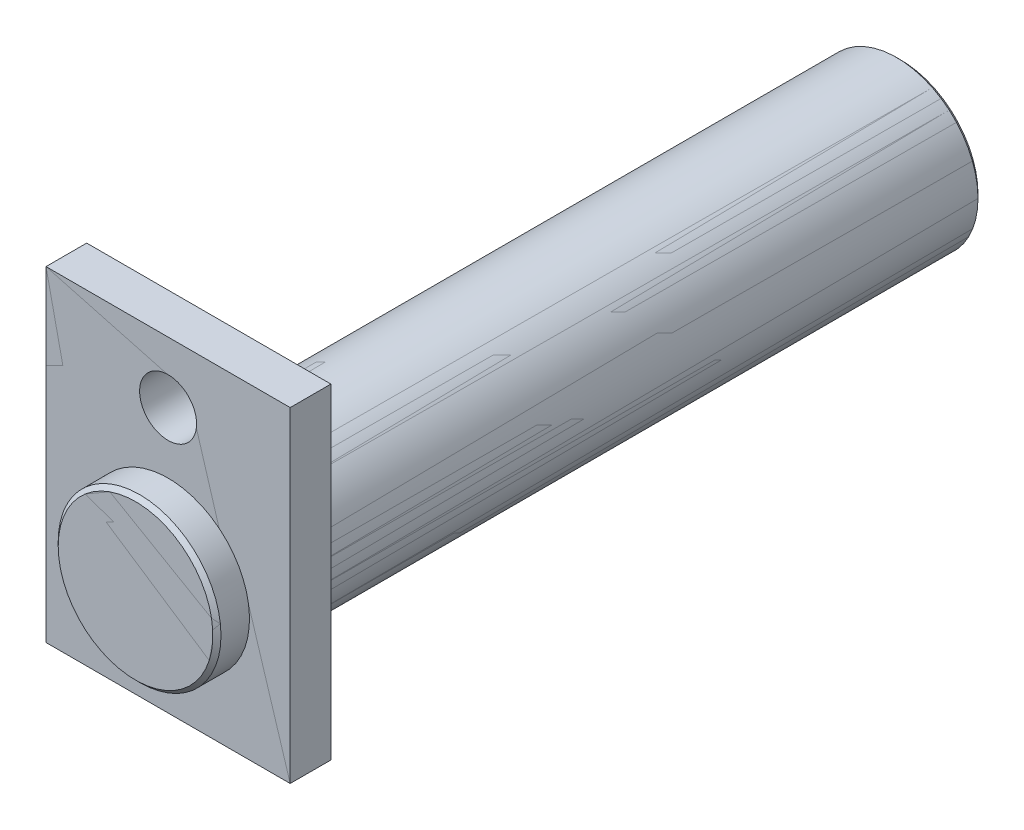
ISO-10303-21;
HEADER;
FILE_DESCRIPTION(('STEP AP214'),'2;1');
FILE_NAME('part.step','',(''),(''),'','','');
FILE_SCHEMA(('AUTOMOTIVE_DESIGN { 1 0 10303 214 1 1 1 1 }'));
ENDSEC;
DATA;
#1=APPLICATION_CONTEXT('core data for automotive mechanical design processes');
#2=APPLICATION_PROTOCOL_DEFINITION('international standard','automotive_design',2000,#1);
#3=PRODUCT_CONTEXT('',#1,'mechanical');
#4=PRODUCT('Part','Part','',(#3));
#5=PRODUCT_RELATED_PRODUCT_CATEGORY('part','',(#4));
#6=PRODUCT_DEFINITION_FORMATION('','',#4);
#7=PRODUCT_DEFINITION_CONTEXT('part definition',#1,'design');
#8=PRODUCT_DEFINITION('design','',#6,#7);
#9=PRODUCT_DEFINITION_SHAPE('','',#8);
#10=(LENGTH_UNIT() NAMED_UNIT(*) SI_UNIT(.MILLI.,.METRE.));
#11=(NAMED_UNIT(*) PLANE_ANGLE_UNIT() SI_UNIT($,.RADIAN.));
#12=(NAMED_UNIT(*) SI_UNIT($,.STERADIAN.) SOLID_ANGLE_UNIT());
#13=UNCERTAINTY_MEASURE_WITH_UNIT(LENGTH_MEASURE(1.E-05),#10,'distance_accuracy_value','');
#14=(GEOMETRIC_REPRESENTATION_CONTEXT(3) GLOBAL_UNCERTAINTY_ASSIGNED_CONTEXT((#13)) GLOBAL_UNIT_ASSIGNED_CONTEXT((#10,
#11,#12)) REPRESENTATION_CONTEXT('',''));
#15=CARTESIAN_POINT('',(0.,0.,0.));
#16=DIRECTION('',(0.,0.,1.));
#17=DIRECTION('',(1.,0.,0.));
#18=AXIS2_PLACEMENT_3D('',#15,#16,#17);
#19=CARTESIAN_POINT('',(9.5,-9.5,-85.));
#20=DIRECTION('',(0.,0.,-1.));
#21=DIRECTION('',(-1.,0.,0.));
#22=AXIS2_PLACEMENT_3D('',#19,#20,#21);
#23=PLANE('',#22);
#24=CARTESIAN_POINT('',(0.,0.,-85.));
#25=DIRECTION('',(0.,0.,1.));
#26=DIRECTION('',(1.,0.,0.));
#27=AXIS2_PLACEMENT_3D('',#24,#25,#26);
#28=CIRCLE('',#27,9.5);
#29=CARTESIAN_POINT('',(9.5,0.,-85.));
#30=VERTEX_POINT('',#29);
#31=EDGE_CURVE('P0_E352',#30,#30,#28,.F.);
#32=ORIENTED_EDGE('',*,*,#31,.T.);
#33=EDGE_LOOP('',(#32));
#34=FACE_BOUND('',#33,.T.);
#35=ADVANCED_FACE('P0_F348',(#34),#23,.T.);
#36=CARTESIAN_POINT('',(0.,0.,-85.));
#37=DIRECTION('',(0.,0.,1.));
#38=DIRECTION('',(1.,0.,0.));
#39=AXIS2_PLACEMENT_3D('',#36,#37,#38);
#40=CONICAL_SURFACE('',#39,9.5,0.785398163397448);
#41=ORIENTED_EDGE('',*,*,#31,.F.);
#42=EDGE_LOOP('',(#41));
#43=FACE_BOUND('',#42,.T.);
#44=CARTESIAN_POINT('',(0.,0.,-84.5));
#45=DIRECTION('',(0.,0.,1.));
#46=DIRECTION('',(1.,0.,0.));
#47=AXIS2_PLACEMENT_3D('',#44,#45,#46);
#48=CIRCLE('',#47,10.);
#49=CARTESIAN_POINT('',(10.,0.,-84.5));
#50=VERTEX_POINT('',#49);
#51=EDGE_CURVE('P0_E440',#50,#50,#48,.F.);
#52=ORIENTED_EDGE('',*,*,#51,.T.);
#53=EDGE_LOOP('',(#52));
#54=FACE_BOUND('',#53,.T.);
#55=ADVANCED_FACE('P0_F454',(#43,#54),#40,.T.);
#56=CARTESIAN_POINT('',(-9.5,-9.5,9.));
#57=DIRECTION('',(0.,0.,1.));
#58=DIRECTION('',(1.,0.,0.));
#59=AXIS2_PLACEMENT_3D('',#56,#57,#58);
#60=PLANE('',#59);
#61=CARTESIAN_POINT('',(0.,0.,9.));
#62=DIRECTION('',(0.,0.,-1.));
#63=DIRECTION('',(-1.,0.,0.));
#64=AXIS2_PLACEMENT_3D('',#61,#62,#63);
#65=CIRCLE('',#64,9.5);
#66=CARTESIAN_POINT('',(-9.5,0.,9.));
#67=VERTEX_POINT('',#66);
#68=EDGE_CURVE('P0_E438',#67,#67,#65,.F.);
#69=ORIENTED_EDGE('',*,*,#68,.T.);
#70=EDGE_LOOP('',(#69));
#71=FACE_BOUND('',#70,.T.);
#72=ADVANCED_FACE('P0_F456',(#71),#60,.T.);
#73=CARTESIAN_POINT('',(0.,0.,-84.5));
#74=DIRECTION('',(0.,0.,1.));
#75=DIRECTION('',(0.,-1.,0.));
#76=AXIS2_PLACEMENT_3D('',#73,#74,#75);
#77=CYLINDRICAL_SURFACE('',#76,10.);
#78=ORIENTED_EDGE('',*,*,#51,.F.);
#79=EDGE_LOOP('',(#78));
#80=FACE_BOUND('',#79,.T.);
#81=CARTESIAN_POINT('',(0.,0.,0.));
#82=DIRECTION('',(0.,0.,1.));
#83=DIRECTION('',(0.,-1.,0.));
#84=AXIS2_PLACEMENT_3D('',#81,#82,#83);
#85=CIRCLE('',#84,10.);
#86=CARTESIAN_POINT('',(0.,-10.0000000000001,0.));
#87=VERTEX_POINT('',#86);
#88=EDGE_CURVE('P0_E400',#87,#87,#85,.T.);
#89=ORIENTED_EDGE('',*,*,#88,.F.);
#90=EDGE_LOOP('',(#89));
#91=FACE_BOUND('',#90,.T.);
#92=ADVANCED_FACE('P0_F462',(#80,#91),#77,.T.);
#93=CARTESIAN_POINT('',(0.,0.,8.5));
#94=DIRECTION('',(0.,0.,-1.));
#95=DIRECTION('',(-1.,0.,0.));
#96=AXIS2_PLACEMENT_3D('',#93,#94,#95);
#97=CONICAL_SURFACE('',#96,10.,0.785398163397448);
#98=CARTESIAN_POINT('',(0.,0.,8.5));
#99=DIRECTION('',(0.,0.,1.));
#100=DIRECTION('',(1.,0.,0.));
#101=AXIS2_PLACEMENT_3D('',#98,#99,#100);
#102=CIRCLE('',#101,10.);
#103=CARTESIAN_POINT('',(10.,0.,8.5));
#104=VERTEX_POINT('',#103);
#105=EDGE_CURVE('P0_E418',#104,#104,#102,.T.);
#106=ORIENTED_EDGE('',*,*,#105,.T.);
#107=EDGE_LOOP('',(#106));
#108=FACE_BOUND('',#107,.T.);
#109=ORIENTED_EDGE('',*,*,#68,.F.);
#110=EDGE_LOOP('',(#109));
#111=FACE_BOUND('',#110,.T.);
#112=ADVANCED_FACE('P0_F496',(#108,#111),#97,.T.);
#113=CARTESIAN_POINT('',(15.,-15.,0.));
#114=DIRECTION('',(0.,0.,-1.));
#115=DIRECTION('',(-1.,0.,0.));
#116=AXIS2_PLACEMENT_3D('',#113,#114,#115);
#117=PLANE('',#116);
#118=CARTESIAN_POINT('',(0.,17.5,0.));
#119=DIRECTION('',(0.,0.,1.));
#120=DIRECTION('',(1.,0.,0.));
#121=AXIS2_PLACEMENT_3D('',#118,#119,#120);
#122=CIRCLE('',#121,3.5);
#123=CARTESIAN_POINT('',(3.5,17.5,0.));
#124=VERTEX_POINT('',#123);
#125=EDGE_CURVE('P0_E424',#124,#124,#122,.F.);
#126=ORIENTED_EDGE('',*,*,#125,.F.);
#127=EDGE_LOOP('',(#126));
#128=FACE_BOUND('',#127,.T.);
#129=ORIENTED_EDGE('',*,*,#88,.T.);
#130=EDGE_LOOP('',(#129));
#131=FACE_BOUND('',#130,.T.);
#132=DIRECTION('',(-1.,0.,0.));
#133=VECTOR('',#132,1.);
#134=CARTESIAN_POINT('',(0.,25.,-1.00613961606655E-13));
#135=LINE('',#134,#133);
#136=CARTESIAN_POINT('',(15.,25.,0.));
#137=VERTEX_POINT('',#136);
#138=CARTESIAN_POINT('',(-15.,25.,0.));
#139=VERTEX_POINT('',#138);
#140=EDGE_CURVE('P0_E403',#137,#139,#135,.T.);
#141=ORIENTED_EDGE('',*,*,#140,.F.);
#142=DIRECTION('',(0.,1.,0.));
#143=VECTOR('',#142,1.);
#144=CARTESIAN_POINT('',(15.,5.,0.));
#145=LINE('',#144,#143);
#146=CARTESIAN_POINT('',(15.,-15.,0.));
#147=VERTEX_POINT('',#146);
#148=EDGE_CURVE('P0_E388',#147,#137,#145,.T.);
#149=ORIENTED_EDGE('',*,*,#148,.F.);
#150=DIRECTION('',(1.,0.,0.));
#151=VECTOR('',#150,1.);
#152=CARTESIAN_POINT('',(0.,-15.,-1.00613961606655E-13));
#153=LINE('',#152,#151);
#154=CARTESIAN_POINT('',(-15.,-15.,0.));
#155=VERTEX_POINT('',#154);
#156=EDGE_CURVE('P0_E419',#155,#147,#153,.T.);
#157=ORIENTED_EDGE('',*,*,#156,.F.);
#158=DIRECTION('',(0.,-1.,0.));
#159=VECTOR('',#158,1.);
#160=CARTESIAN_POINT('',(-15.,5.,0.));
#161=LINE('',#160,#159);
#162=EDGE_CURVE('P0_E405',#139,#155,#161,.T.);
#163=ORIENTED_EDGE('',*,*,#162,.F.);
#164=EDGE_LOOP('',(#141,#149,#157,#163));
#165=FACE_BOUND('',#164,.T.);
#166=ADVANCED_FACE('P0_F404',(#128,#131,#165),#117,.T.);
#167=CARTESIAN_POINT('',(15.,-15.,5.));
#168=DIRECTION('',(1.,0.,0.));
#169=DIRECTION('',(0.,0.,-1.));
#170=AXIS2_PLACEMENT_3D('',#167,#168,#169);
#171=PLANE('',#170);
#172=ORIENTED_EDGE('',*,*,#148,.T.);
#173=DIRECTION('',(0.,0.,-1.));
#174=VECTOR('',#173,1.);
#175=CARTESIAN_POINT('',(15.,25.,-10.));
#176=LINE('',#175,#174);
#177=CARTESIAN_POINT('',(15.,25.,5.));
#178=VERTEX_POINT('',#177);
#179=EDGE_CURVE('P0_E396',#178,#137,#176,.T.);
#180=ORIENTED_EDGE('',*,*,#179,.F.);
#181=DIRECTION('',(0.,1.,0.));
#182=VECTOR('',#181,1.);
#183=CARTESIAN_POINT('',(15.,5.,5.));
#184=LINE('',#183,#182);
#185=CARTESIAN_POINT('',(15.,-15.,5.));
#186=VERTEX_POINT('',#185);
#187=EDGE_CURVE('P0_E381',#186,#178,#184,.T.);
#188=ORIENTED_EDGE('',*,*,#187,.F.);
#189=DIRECTION('',(0.,0.,1.));
#190=VECTOR('',#189,1.);
#191=CARTESIAN_POINT('',(15.,-15.,-10.));
#192=LINE('',#191,#190);
#193=EDGE_CURVE('P0_E398',#147,#186,#192,.T.);
#194=ORIENTED_EDGE('',*,*,#193,.F.);
#195=EDGE_LOOP('',(#172,#180,#188,#194));
#196=FACE_BOUND('',#195,.T.);
#197=ADVANCED_FACE('P0_F394',(#196),#171,.T.);
#198=CARTESIAN_POINT('',(15.,25.,5.));
#199=DIRECTION('',(0.,1.,0.));
#200=DIRECTION('',(0.,0.,-1.));
#201=AXIS2_PLACEMENT_3D('',#198,#199,#200);
#202=PLANE('',#201);
#203=ORIENTED_EDGE('',*,*,#140,.T.);
#204=DIRECTION('',(0.,0.,-1.));
#205=VECTOR('',#204,1.);
#206=CARTESIAN_POINT('',(-15.,25.,-15.));
#207=LINE('',#206,#205);
#208=CARTESIAN_POINT('',(-15.,25.,5.));
#209=VERTEX_POINT('',#208);
#210=EDGE_CURVE('P0_E408',#209,#139,#207,.T.);
#211=ORIENTED_EDGE('',*,*,#210,.F.);
#212=DIRECTION('',(-1.,0.,0.));
#213=VECTOR('',#212,1.);
#214=CARTESIAN_POINT('',(5.,25.,5.));
#215=LINE('',#214,#213);
#216=EDGE_CURVE('P0_E412',#178,#209,#215,.T.);
#217=ORIENTED_EDGE('',*,*,#216,.F.);
#218=ORIENTED_EDGE('',*,*,#179,.T.);
#219=EDGE_LOOP('',(#203,#211,#217,#218));
#220=FACE_BOUND('',#219,.T.);
#221=ADVANCED_FACE('P0_F410',(#220),#202,.T.);
#222=CARTESIAN_POINT('',(-15.,25.,5.));
#223=DIRECTION('',(-1.,0.,0.));
#224=DIRECTION('',(0.,0.,-1.));
#225=AXIS2_PLACEMENT_3D('',#222,#223,#224);
#226=PLANE('',#225);
#227=ORIENTED_EDGE('',*,*,#162,.T.);
#228=DIRECTION('',(0.,0.,-1.));
#229=VECTOR('',#228,1.);
#230=CARTESIAN_POINT('',(-15.,-15.,-10.));
#231=LINE('',#230,#229);
#232=CARTESIAN_POINT('',(-15.,-15.,5.));
#233=VERTEX_POINT('',#232);
#234=EDGE_CURVE('P0_E367',#233,#155,#231,.T.);
#235=ORIENTED_EDGE('',*,*,#234,.F.);
#236=DIRECTION('',(0.,-1.,0.));
#237=VECTOR('',#236,1.);
#238=CARTESIAN_POINT('',(-15.,5.,5.));
#239=LINE('',#238,#237);
#240=EDGE_CURVE('P0_E428',#209,#233,#239,.T.);
#241=ORIENTED_EDGE('',*,*,#240,.F.);
#242=ORIENTED_EDGE('',*,*,#210,.T.);
#243=EDGE_LOOP('',(#227,#235,#241,#242));
#244=FACE_BOUND('',#243,.T.);
#245=ADVANCED_FACE('P0_F479',(#244),#226,.T.);
#246=CARTESIAN_POINT('',(-15.,-15.,5.));
#247=DIRECTION('',(0.,-1.,0.));
#248=DIRECTION('',(0.,0.,-1.));
#249=AXIS2_PLACEMENT_3D('',#246,#247,#248);
#250=PLANE('',#249);
#251=ORIENTED_EDGE('',*,*,#156,.T.);
#252=ORIENTED_EDGE('',*,*,#193,.T.);
#253=DIRECTION('',(1.,0.,0.));
#254=VECTOR('',#253,1.);
#255=CARTESIAN_POINT('',(5.,-15.,5.));
#256=LINE('',#255,#254);
#257=EDGE_CURVE('P0_E425',#233,#186,#256,.T.);
#258=ORIENTED_EDGE('',*,*,#257,.F.);
#259=ORIENTED_EDGE('',*,*,#234,.T.);
#260=EDGE_LOOP('',(#251,#252,#258,#259));
#261=FACE_BOUND('',#260,.T.);
#262=ADVANCED_FACE('P0_F481',(#261),#250,.T.);
#263=CARTESIAN_POINT('',(0.,0.,5.));
#264=DIRECTION('',(0.,0.,1.));
#265=DIRECTION('',(0.,-1.,0.));
#266=AXIS2_PLACEMENT_3D('',#263,#264,#265);
#267=CYLINDRICAL_SURFACE('',#266,10.);
#268=CARTESIAN_POINT('',(0.,0.,5.));
#269=DIRECTION('',(0.,0.,1.));
#270=DIRECTION('',(0.,-1.,0.));
#271=AXIS2_PLACEMENT_3D('',#268,#269,#270);
#272=CIRCLE('',#271,10.);
#273=CARTESIAN_POINT('',(0.,-10.,5.));
#274=VERTEX_POINT('',#273);
#275=EDGE_CURVE('P0_E358',#274,#274,#272,.F.);
#276=ORIENTED_EDGE('',*,*,#275,.F.);
#277=EDGE_LOOP('',(#276));
#278=FACE_BOUND('',#277,.T.);
#279=ORIENTED_EDGE('',*,*,#105,.F.);
#280=EDGE_LOOP('',(#279));
#281=FACE_BOUND('',#280,.T.);
#282=ADVANCED_FACE('P0_F472',(#278,#281),#267,.T.);
#283=CARTESIAN_POINT('',(0.,17.5,0.));
#284=DIRECTION('',(0.,0.,1.));
#285=DIRECTION('',(1.,0.,0.));
#286=AXIS2_PLACEMENT_3D('',#283,#284,#285);
#287=CYLINDRICAL_SURFACE('',#286,3.5);
#288=ORIENTED_EDGE('',*,*,#125,.T.);
#289=EDGE_LOOP('',(#288));
#290=FACE_BOUND('',#289,.T.);
#291=CARTESIAN_POINT('',(0.,17.5,5.));
#292=DIRECTION('',(0.,0.,1.));
#293=DIRECTION('',(1.,0.,0.));
#294=AXIS2_PLACEMENT_3D('',#291,#292,#293);
#295=CIRCLE('',#294,3.5);
#296=CARTESIAN_POINT('',(3.5,17.5,5.));
#297=VERTEX_POINT('',#296);
#298=EDGE_CURVE('P0_E11',#297,#297,#295,.F.);
#299=ORIENTED_EDGE('',*,*,#298,.F.);
#300=EDGE_LOOP('',(#299));
#301=FACE_BOUND('',#300,.T.);
#302=ADVANCED_FACE('P0_F467',(#290,#301),#287,.F.);
#303=CARTESIAN_POINT('',(-15.,-15.,5.));
#304=DIRECTION('',(0.,0.,1.));
#305=DIRECTION('',(1.,0.,0.));
#306=AXIS2_PLACEMENT_3D('',#303,#304,#305);
#307=PLANE('',#306);
#308=ORIENTED_EDGE('',*,*,#298,.T.);
#309=EDGE_LOOP('',(#308));
#310=FACE_BOUND('',#309,.T.);
#311=ORIENTED_EDGE('',*,*,#275,.T.);
#312=EDGE_LOOP('',(#311));
#313=FACE_BOUND('',#312,.T.);
#314=ORIENTED_EDGE('',*,*,#240,.T.);
#315=ORIENTED_EDGE('',*,*,#257,.T.);
#316=ORIENTED_EDGE('',*,*,#187,.T.);
#317=ORIENTED_EDGE('',*,*,#216,.T.);
#318=EDGE_LOOP('',(#314,#315,#316,#317));
#319=FACE_BOUND('',#318,.T.);
#320=ADVANCED_FACE('P0_F350',(#310,#313,#319),#307,.T.);
#321=CLOSED_SHELL('',(#35,#55,#72,#92,#112,#166,#197,#221,#245,#262,#282,#302,#320));
#322=MANIFOLD_SOLID_BREP('P0_B2',#321);
#323=CARTESIAN_POINT('',(9.5,-9.5,-85.));
#324=DIRECTION('',(0.,0.,-1.));
#325=DIRECTION('',(-1.,0.,0.));
#326=AXIS2_PLACEMENT_3D('',#323,#324,#325);
#327=PLANE('',#326);
#328=CARTESIAN_POINT('',(0.,0.,-85.));
#329=DIRECTION('',(0.,0.,1.));
#330=DIRECTION('',(1.,0.,0.));
#331=AXIS2_PLACEMENT_3D('',#328,#329,#330);
#332=CIRCLE('',#331,9.5);
#333=CARTESIAN_POINT('',(9.5,0.,-85.));
#334=VERTEX_POINT('',#333);
#335=EDGE_CURVE('P1_E19',#334,#334,#332,.F.);
#336=ORIENTED_EDGE('',*,*,#335,.T.);
#337=EDGE_LOOP('',(#336));
#338=FACE_BOUND('',#337,.T.);
#339=ADVANCED_FACE('P1_F15',(#338),#327,.T.);
#340=CARTESIAN_POINT('',(0.,0.,-85.));
#341=DIRECTION('',(0.,0.,1.));
#342=DIRECTION('',(1.,0.,0.));
#343=AXIS2_PLACEMENT_3D('',#340,#341,#342);
#344=CONICAL_SURFACE('',#343,9.5,0.785398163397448);
#345=ORIENTED_EDGE('',*,*,#335,.F.);
#346=EDGE_LOOP('',(#345));
#347=FACE_BOUND('',#346,.T.);
#348=CARTESIAN_POINT('',(0.,0.,-84.5));
#349=DIRECTION('',(0.,0.,1.));
#350=DIRECTION('',(1.,0.,0.));
#351=AXIS2_PLACEMENT_3D('',#348,#349,#350);
#352=CIRCLE('',#351,10.);
#353=CARTESIAN_POINT('',(10.,0.,-84.5));
#354=VERTEX_POINT('',#353);
#355=EDGE_CURVE('P1_E107',#354,#354,#352,.F.);
#356=ORIENTED_EDGE('',*,*,#355,.T.);
#357=EDGE_LOOP('',(#356));
#358=FACE_BOUND('',#357,.T.);
#359=ADVANCED_FACE('P1_F118',(#347,#358),#344,.T.);
#360=CARTESIAN_POINT('',(-9.5,-9.5,9.));
#361=DIRECTION('',(0.,0.,1.));
#362=DIRECTION('',(1.,0.,0.));
#363=AXIS2_PLACEMENT_3D('',#360,#361,#362);
#364=PLANE('',#363);
#365=CARTESIAN_POINT('',(0.,0.,9.));
#366=DIRECTION('',(0.,0.,-1.));
#367=DIRECTION('',(-1.,0.,0.));
#368=AXIS2_PLACEMENT_3D('',#365,#366,#367);
#369=CIRCLE('',#368,9.5);
#370=CARTESIAN_POINT('',(-9.5,0.,9.));
#371=VERTEX_POINT('',#370);
#372=EDGE_CURVE('P1_E105',#371,#371,#369,.F.);
#373=ORIENTED_EDGE('',*,*,#372,.T.);
#374=EDGE_LOOP('',(#373));
#375=FACE_BOUND('',#374,.T.);
#376=ADVANCED_FACE('P1_F120',(#375),#364,.T.);
#377=CARTESIAN_POINT('',(0.,0.,-84.5));
#378=DIRECTION('',(0.,0.,1.));
#379=DIRECTION('',(0.,-1.,0.));
#380=AXIS2_PLACEMENT_3D('',#377,#378,#379);
#381=CYLINDRICAL_SURFACE('',#380,10.);
#382=ORIENTED_EDGE('',*,*,#355,.F.);
#383=EDGE_LOOP('',(#382));
#384=FACE_BOUND('',#383,.T.);
#385=CARTESIAN_POINT('',(0.,0.,0.));
#386=DIRECTION('',(0.,0.,1.));
#387=DIRECTION('',(0.,-1.,0.));
#388=AXIS2_PLACEMENT_3D('',#385,#386,#387);
#389=CIRCLE('',#388,10.);
#390=CARTESIAN_POINT('',(0.,-10.0000000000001,0.));
#391=VERTEX_POINT('',#390);
#392=EDGE_CURVE('P1_E67',#391,#391,#389,.T.);
#393=ORIENTED_EDGE('',*,*,#392,.F.);
#394=EDGE_LOOP('',(#393));
#395=FACE_BOUND('',#394,.T.);
#396=ADVANCED_FACE('P1_F125',(#384,#395),#381,.T.);
#397=CARTESIAN_POINT('',(0.,0.,8.5));
#398=DIRECTION('',(0.,0.,-1.));
#399=DIRECTION('',(-1.,0.,0.));
#400=AXIS2_PLACEMENT_3D('',#397,#398,#399);
#401=CONICAL_SURFACE('',#400,10.,0.785398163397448);
#402=CARTESIAN_POINT('',(0.,0.,8.5));
#403=DIRECTION('',(0.,0.,1.));
#404=DIRECTION('',(1.,0.,0.));
#405=AXIS2_PLACEMENT_3D('',#402,#403,#404);
#406=CIRCLE('',#405,10.);
#407=CARTESIAN_POINT('',(10.,0.,8.5));
#408=VERTEX_POINT('',#407);
#409=EDGE_CURVE('P1_E85',#408,#408,#406,.T.);
#410=ORIENTED_EDGE('',*,*,#409,.T.);
#411=EDGE_LOOP('',(#410));
#412=FACE_BOUND('',#411,.T.);
#413=ORIENTED_EDGE('',*,*,#372,.F.);
#414=EDGE_LOOP('',(#413));
#415=FACE_BOUND('',#414,.T.);
#416=ADVANCED_FACE('P1_F158',(#412,#415),#401,.T.);
#417=CARTESIAN_POINT('',(15.,-15.,0.));
#418=DIRECTION('',(0.,0.,-1.));
#419=DIRECTION('',(-1.,0.,0.));
#420=AXIS2_PLACEMENT_3D('',#417,#418,#419);
#421=PLANE('',#420);
#422=CARTESIAN_POINT('',(0.,17.5,0.));
#423=DIRECTION('',(0.,0.,1.));
#424=DIRECTION('',(1.,0.,0.));
#425=AXIS2_PLACEMENT_3D('',#422,#423,#424);
#426=CIRCLE('',#425,3.5);
#427=CARTESIAN_POINT('',(3.5,17.5,0.));
#428=VERTEX_POINT('',#427);
#429=EDGE_CURVE('P1_E91',#428,#428,#426,.F.);
#430=ORIENTED_EDGE('',*,*,#429,.F.);
#431=EDGE_LOOP('',(#430));
#432=FACE_BOUND('',#431,.T.);
#433=ORIENTED_EDGE('',*,*,#392,.T.);
#434=EDGE_LOOP('',(#433));
#435=FACE_BOUND('',#434,.T.);
#436=DIRECTION('',(-1.,0.,0.));
#437=VECTOR('',#436,1.);
#438=CARTESIAN_POINT('',(0.,25.,-1.00613961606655E-13));
#439=LINE('',#438,#437);
#440=CARTESIAN_POINT('',(15.,25.,0.));
#441=VERTEX_POINT('',#440);
#442=CARTESIAN_POINT('',(-15.,25.,0.));
#443=VERTEX_POINT('',#442);
#444=EDGE_CURVE('P1_E70',#441,#443,#439,.T.);
#445=ORIENTED_EDGE('',*,*,#444,.F.);
#446=DIRECTION('',(0.,1.,0.));
#447=VECTOR('',#446,1.);
#448=CARTESIAN_POINT('',(15.,5.,0.));
#449=LINE('',#448,#447);
#450=CARTESIAN_POINT('',(15.,-15.,0.));
#451=VERTEX_POINT('',#450);
#452=EDGE_CURVE('P1_E55',#451,#441,#449,.T.);
#453=ORIENTED_EDGE('',*,*,#452,.F.);
#454=DIRECTION('',(1.,0.,0.));
#455=VECTOR('',#454,1.);
#456=CARTESIAN_POINT('',(0.,-15.,-1.00613961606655E-13));
#457=LINE('',#456,#455);
#458=CARTESIAN_POINT('',(-15.,-15.,0.));
#459=VERTEX_POINT('',#458);
#460=EDGE_CURVE('P1_E86',#459,#451,#457,.T.);
#461=ORIENTED_EDGE('',*,*,#460,.F.);
#462=DIRECTION('',(0.,-1.,0.));
#463=VECTOR('',#462,1.);
#464=CARTESIAN_POINT('',(-15.,5.,0.));
#465=LINE('',#464,#463);
#466=EDGE_CURVE('P1_E72',#443,#459,#465,.T.);
#467=ORIENTED_EDGE('',*,*,#466,.F.);
#468=EDGE_LOOP('',(#445,#453,#461,#467));
#469=FACE_BOUND('',#468,.T.);
#470=ADVANCED_FACE('P1_F71',(#432,#435,#469),#421,.T.);
#471=CARTESIAN_POINT('',(15.,-15.,5.));
#472=DIRECTION('',(1.,0.,0.));
#473=DIRECTION('',(0.,0.,-1.));
#474=AXIS2_PLACEMENT_3D('',#471,#472,#473);
#475=PLANE('',#474);
#476=ORIENTED_EDGE('',*,*,#452,.T.);
#477=DIRECTION('',(0.,0.,-1.));
#478=VECTOR('',#477,1.);
#479=CARTESIAN_POINT('',(15.,25.,-10.));
#480=LINE('',#479,#478);
#481=CARTESIAN_POINT('',(15.,25.,5.));
#482=VERTEX_POINT('',#481);
#483=EDGE_CURVE('P1_E63',#482,#441,#480,.T.);
#484=ORIENTED_EDGE('',*,*,#483,.F.);
#485=DIRECTION('',(0.,1.,0.));
#486=VECTOR('',#485,1.);
#487=CARTESIAN_POINT('',(15.,5.,5.));
#488=LINE('',#487,#486);
#489=CARTESIAN_POINT('',(15.,-15.,5.));
#490=VERTEX_POINT('',#489);
#491=EDGE_CURVE('P1_E48',#490,#482,#488,.T.);
#492=ORIENTED_EDGE('',*,*,#491,.F.);
#493=DIRECTION('',(0.,0.,1.));
#494=VECTOR('',#493,1.);
#495=CARTESIAN_POINT('',(15.,-15.,-10.));
#496=LINE('',#495,#494);
#497=EDGE_CURVE('P1_E65',#451,#490,#496,.T.);
#498=ORIENTED_EDGE('',*,*,#497,.F.);
#499=EDGE_LOOP('',(#476,#484,#492,#498));
#500=FACE_BOUND('',#499,.T.);
#501=ADVANCED_FACE('P1_F61',(#500),#475,.T.);
#502=CARTESIAN_POINT('',(15.,25.,5.));
#503=DIRECTION('',(0.,1.,0.));
#504=DIRECTION('',(0.,0.,-1.));
#505=AXIS2_PLACEMENT_3D('',#502,#503,#504);
#506=PLANE('',#505);
#507=ORIENTED_EDGE('',*,*,#444,.T.);
#508=DIRECTION('',(0.,0.,-1.));
#509=VECTOR('',#508,1.);
#510=CARTESIAN_POINT('',(-15.,25.,-15.));
#511=LINE('',#510,#509);
#512=CARTESIAN_POINT('',(-15.,25.,5.));
#513=VERTEX_POINT('',#512);
#514=EDGE_CURVE('P1_E75',#513,#443,#511,.T.);
#515=ORIENTED_EDGE('',*,*,#514,.F.);
#516=DIRECTION('',(-1.,0.,0.));
#517=VECTOR('',#516,1.);
#518=CARTESIAN_POINT('',(5.,25.,5.));
#519=LINE('',#518,#517);
#520=EDGE_CURVE('P1_E79',#482,#513,#519,.T.);
#521=ORIENTED_EDGE('',*,*,#520,.F.);
#522=ORIENTED_EDGE('',*,*,#483,.T.);
#523=EDGE_LOOP('',(#507,#515,#521,#522));
#524=FACE_BOUND('',#523,.T.);
#525=ADVANCED_FACE('P1_F77',(#524),#506,.T.);
#526=CARTESIAN_POINT('',(-15.,25.,5.));
#527=DIRECTION('',(-1.,0.,0.));
#528=DIRECTION('',(0.,0.,-1.));
#529=AXIS2_PLACEMENT_3D('',#526,#527,#528);
#530=PLANE('',#529);
#531=ORIENTED_EDGE('',*,*,#466,.T.);
#532=DIRECTION('',(0.,0.,-1.));
#533=VECTOR('',#532,1.);
#534=CARTESIAN_POINT('',(-15.,-15.,-10.));
#535=LINE('',#534,#533);
#536=CARTESIAN_POINT('',(-15.,-15.,5.));
#537=VERTEX_POINT('',#536);
#538=EDGE_CURVE('P1_E34',#537,#459,#535,.T.);
#539=ORIENTED_EDGE('',*,*,#538,.F.);
#540=DIRECTION('',(0.,-1.,0.));
#541=VECTOR('',#540,1.);
#542=CARTESIAN_POINT('',(-15.,5.,5.));
#543=LINE('',#542,#541);
#544=EDGE_CURVE('P1_E95',#513,#537,#543,.T.);
#545=ORIENTED_EDGE('',*,*,#544,.F.);
#546=ORIENTED_EDGE('',*,*,#514,.T.);
#547=EDGE_LOOP('',(#531,#539,#545,#546));
#548=FACE_BOUND('',#547,.T.);
#549=ADVANCED_FACE('P1_F142',(#548),#530,.T.);
#550=CARTESIAN_POINT('',(-15.,-15.,5.));
#551=DIRECTION('',(0.,-1.,0.));
#552=DIRECTION('',(0.,0.,-1.));
#553=AXIS2_PLACEMENT_3D('',#550,#551,#552);
#554=PLANE('',#553);
#555=ORIENTED_EDGE('',*,*,#460,.T.);
#556=ORIENTED_EDGE('',*,*,#497,.T.);
#557=DIRECTION('',(1.,0.,0.));
#558=VECTOR('',#557,1.);
#559=CARTESIAN_POINT('',(5.,-15.,5.));
#560=LINE('',#559,#558);
#561=EDGE_CURVE('P1_E92',#537,#490,#560,.T.);
#562=ORIENTED_EDGE('',*,*,#561,.F.);
#563=ORIENTED_EDGE('',*,*,#538,.T.);
#564=EDGE_LOOP('',(#555,#556,#562,#563));
#565=FACE_BOUND('',#564,.T.);
#566=ADVANCED_FACE('P1_F144',(#565),#554,.T.);
#567=CARTESIAN_POINT('',(0.,0.,5.));
#568=DIRECTION('',(0.,0.,1.));
#569=DIRECTION('',(0.,-1.,0.));
#570=AXIS2_PLACEMENT_3D('',#567,#568,#569);
#571=CYLINDRICAL_SURFACE('',#570,10.);
#572=CARTESIAN_POINT('',(0.,0.,5.));
#573=DIRECTION('',(0.,0.,1.));
#574=DIRECTION('',(0.,-1.,0.));
#575=AXIS2_PLACEMENT_3D('',#572,#573,#574);
#576=CIRCLE('',#575,10.);
#577=CARTESIAN_POINT('',(0.,-10.,5.));
#578=VERTEX_POINT('',#577);
#579=EDGE_CURVE('P1_E25',#578,#578,#576,.F.);
#580=ORIENTED_EDGE('',*,*,#579,.F.);
#581=EDGE_LOOP('',(#580));
#582=FACE_BOUND('',#581,.T.);
#583=ORIENTED_EDGE('',*,*,#409,.F.);
#584=EDGE_LOOP('',(#583));
#585=FACE_BOUND('',#584,.T.);
#586=ADVANCED_FACE('P1_F135',(#582,#585),#571,.T.);
#587=CARTESIAN_POINT('',(0.,17.5,0.));
#588=DIRECTION('',(0.,0.,1.));
#589=DIRECTION('',(1.,0.,0.));
#590=AXIS2_PLACEMENT_3D('',#587,#588,#589);
#591=CYLINDRICAL_SURFACE('',#590,3.5);
#592=ORIENTED_EDGE('',*,*,#429,.T.);
#593=EDGE_LOOP('',(#592));
#594=FACE_BOUND('',#593,.T.);
#595=CARTESIAN_POINT('',(0.,17.5,5.));
#596=DIRECTION('',(0.,0.,1.));
#597=DIRECTION('',(1.,0.,0.));
#598=AXIS2_PLACEMENT_3D('',#595,#596,#597);
#599=CIRCLE('',#598,3.5);
#600=CARTESIAN_POINT('',(3.5,17.5,5.));
#601=VERTEX_POINT('',#600);
#602=EDGE_CURVE('P1_E10',#601,#601,#599,.F.);
#603=ORIENTED_EDGE('',*,*,#602,.F.);
#604=EDGE_LOOP('',(#603));
#605=FACE_BOUND('',#604,.T.);
#606=ADVANCED_FACE('P1_F131',(#594,#605),#591,.F.);
#607=CARTESIAN_POINT('',(-15.,-15.,5.));
#608=DIRECTION('',(0.,0.,1.));
#609=DIRECTION('',(1.,0.,0.));
#610=AXIS2_PLACEMENT_3D('',#607,#608,#609);
#611=PLANE('',#610);
#612=ORIENTED_EDGE('',*,*,#602,.T.);
#613=EDGE_LOOP('',(#612));
#614=FACE_BOUND('',#613,.T.);
#615=ORIENTED_EDGE('',*,*,#579,.T.);
#616=EDGE_LOOP('',(#615));
#617=FACE_BOUND('',#616,.T.);
#618=ORIENTED_EDGE('',*,*,#544,.T.);
#619=ORIENTED_EDGE('',*,*,#561,.T.);
#620=ORIENTED_EDGE('',*,*,#491,.T.);
#621=ORIENTED_EDGE('',*,*,#520,.T.);
#622=EDGE_LOOP('',(#618,#619,#620,#621));
#623=FACE_BOUND('',#622,.T.);
#624=ADVANCED_FACE('P1_F17',(#614,#617,#623),#611,.T.);
#625=CLOSED_SHELL('',(#339,#359,#376,#396,#416,#470,#501,#525,#549,#566,#586,#606,#624));
#626=MANIFOLD_SOLID_BREP('P1_B1',#625);
#627=ADVANCED_BREP_SHAPE_REPRESENTATION('',(#18,#322,#626),#14);
#628=SHAPE_DEFINITION_REPRESENTATION(#9,#627);
ENDSEC;
END-ISO-10303-21;
